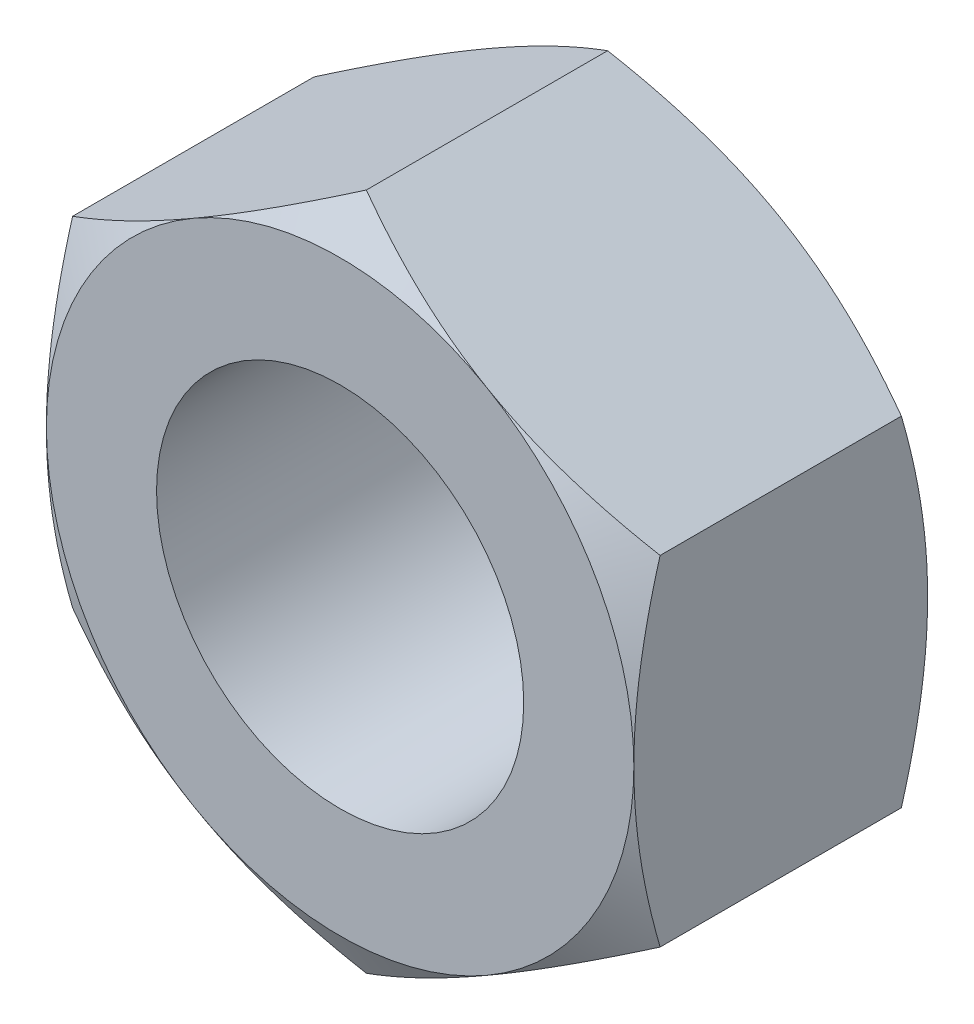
ISO-10303-21;
HEADER;
FILE_DESCRIPTION(('STEP AP214'),'2;1');
FILE_NAME('part.step','',(''),(''),'','','');
FILE_SCHEMA(('AUTOMOTIVE_DESIGN { 1 0 10303 214 1 1 1 1 }'));
ENDSEC;
DATA;
#1=APPLICATION_CONTEXT('core data for automotive mechanical design processes');
#2=APPLICATION_PROTOCOL_DEFINITION('international standard','automotive_design',2000,#1);
#3=PRODUCT_CONTEXT('',#1,'mechanical');
#4=PRODUCT('Part','Part','',(#3));
#5=PRODUCT_RELATED_PRODUCT_CATEGORY('part','',(#4));
#6=PRODUCT_DEFINITION_FORMATION('','',#4);
#7=PRODUCT_DEFINITION_CONTEXT('part definition',#1,'design');
#8=PRODUCT_DEFINITION('design','',#6,#7);
#9=PRODUCT_DEFINITION_SHAPE('','',#8);
#10=(LENGTH_UNIT() NAMED_UNIT(*) SI_UNIT(.MILLI.,.METRE.));
#11=(NAMED_UNIT(*) PLANE_ANGLE_UNIT() SI_UNIT($,.RADIAN.));
#12=(NAMED_UNIT(*) SI_UNIT($,.STERADIAN.) SOLID_ANGLE_UNIT());
#13=UNCERTAINTY_MEASURE_WITH_UNIT(LENGTH_MEASURE(1.E-05),#10,'distance_accuracy_value','');
#14=(GEOMETRIC_REPRESENTATION_CONTEXT(3) GLOBAL_UNCERTAINTY_ASSIGNED_CONTEXT((#13)) GLOBAL_UNIT_ASSIGNED_CONTEXT((#10,
#11,#12)) REPRESENTATION_CONTEXT('',''));
#15=CARTESIAN_POINT('',(0.,0.,0.));
#16=DIRECTION('',(0.,0.,1.));
#17=DIRECTION('',(1.,0.,0.));
#18=AXIS2_PLACEMENT_3D('',#15,#16,#17);
#19=CARTESIAN_POINT('',(-8.,13.856406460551,0.));
#20=DIRECTION('',(0.,0.,-1.));
#21=DIRECTION('',(-1.,0.,0.));
#22=AXIS2_PLACEMENT_3D('',#19,#20,#21);
#23=PLANE('',#22);
#24=CARTESIAN_POINT('',(0.,0.,0.));
#25=DIRECTION('',(0.,0.,1.));
#26=DIRECTION('',(1.,0.,0.));
#27=AXIS2_PLACEMENT_3D('',#24,#25,#26);
#28=CIRCLE('',#27,5.);
#29=CARTESIAN_POINT('',(5.,0.,0.));
#30=VERTEX_POINT('',#29);
#31=EDGE_CURVE('E316',#30,#30,#28,.T.);
#32=ORIENTED_EDGE('',*,*,#31,.F.);
#33=EDGE_LOOP('',(#32));
#34=FACE_BOUND('',#33,.T.);
#35=CARTESIAN_POINT('',(0.,0.,0.));
#36=DIRECTION('',(0.,0.,-1.));
#37=DIRECTION('',(-1.,0.,0.));
#38=AXIS2_PLACEMENT_3D('',#35,#36,#37);
#39=CIRCLE('',#38,8.);
#40=CARTESIAN_POINT('',(-8.,0.,0.));
#41=VERTEX_POINT('',#40);
#42=CARTESIAN_POINT('',(-4.,6.92820323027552,0.));
#43=VERTEX_POINT('',#42);
#44=EDGE_CURVE('E324',#41,#43,#39,.T.);
#45=ORIENTED_EDGE('',*,*,#44,.F.);
#46=CARTESIAN_POINT('',(0.,0.,0.));
#47=DIRECTION('',(0.,0.,-1.));
#48=DIRECTION('',(-1.,0.,0.));
#49=AXIS2_PLACEMENT_3D('',#46,#47,#48);
#50=CIRCLE('',#49,8.);
#51=CARTESIAN_POINT('',(-4.,-6.92820323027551,0.));
#52=VERTEX_POINT('',#51);
#53=EDGE_CURVE('E146',#41,#52,#50,.F.);
#54=ORIENTED_EDGE('',*,*,#53,.T.);
#55=CARTESIAN_POINT('',(4.,-6.92820323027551,0.));
#56=VERTEX_POINT('',#55);
#57=EDGE_CURVE('E248',#52,#56,#50,.F.);
#58=ORIENTED_EDGE('',*,*,#57,.T.);
#59=CARTESIAN_POINT('',(8.,0.,0.));
#60=VERTEX_POINT('',#59);
#61=EDGE_CURVE('E149',#56,#60,#50,.F.);
#62=ORIENTED_EDGE('',*,*,#61,.T.);
#63=CARTESIAN_POINT('',(4.,6.92820323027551,0.));
#64=VERTEX_POINT('',#63);
#65=EDGE_CURVE('E124',#60,#64,#50,.F.);
#66=ORIENTED_EDGE('',*,*,#65,.T.);
#67=EDGE_CURVE('E137',#64,#43,#50,.F.);
#68=ORIENTED_EDGE('',*,*,#67,.T.);
#69=EDGE_LOOP('',(#45,#54,#58,#62,#66,#68));
#70=FACE_BOUND('',#69,.T.);
#71=ADVANCED_FACE('F29',(#34,#70),#23,.F.);
#72=CARTESIAN_POINT('',(0.,0.,0.));
#73=DIRECTION('',(0.,0.,-1.));
#74=DIRECTION('',(-1.,0.,0.));
#75=AXIS2_PLACEMENT_3D('',#72,#73,#74);
#76=CONICAL_SURFACE('',#75,8.,1.0471975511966);
#77=CARTESIAN_POINT('',(-8.,-12.4289414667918,-3.9150243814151));
#78=CARTESIAN_POINT('',(-8.,-12.0792916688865,-3.74532345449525));
#79=CARTESIAN_POINT('',(-8.,-11.7288415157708,-3.57724345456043));
#80=CARTESIAN_POINT('',(-8.,-11.0259148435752,-3.24523667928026));
#81=CARTESIAN_POINT('',(-8.,-10.6734380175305,-3.08131055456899));
#82=CARTESIAN_POINT('',(-8.,-9.96422754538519,-2.75770323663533));
#83=CARTESIAN_POINT('',(-8.,-9.60748118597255,-2.598049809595));
#84=CARTESIAN_POINT('',(-8.,-8.89115828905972,-2.28524838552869));
#85=CARTESIAN_POINT('',(-8.,-8.53158188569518,-2.13210008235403));
#86=CARTESIAN_POINT('',(-8.,-7.79743820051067,-1.82924542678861));
#87=CARTESIAN_POINT('',(-8.,-7.42275986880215,-1.67980678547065));
#88=CARTESIAN_POINT('',(-8.,-6.66902920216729,-1.39218569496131));
#89=CARTESIAN_POINT('',(-8.,-6.28997638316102,-1.2540045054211));
#90=CARTESIAN_POINT('',(-8.,-5.52759087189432,-0.992509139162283));
#91=CARTESIAN_POINT('',(-8.,-5.14426853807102,-0.869165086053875));
#92=CARTESIAN_POINT('',(-8.,-4.37213964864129,-0.641285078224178));
#93=CARTESIAN_POINT('',(-8.,-3.98333485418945,-0.536743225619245));
#94=CARTESIAN_POINT('',(-8.,-3.2020639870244,-0.352019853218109));
#95=CARTESIAN_POINT('',(-8.,-2.80962942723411,-0.271708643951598));
#96=CARTESIAN_POINT('',(-8.,-2.21738673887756,-0.17289261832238));
#97=CARTESIAN_POINT('',(-8.,-2.01935997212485,-0.143561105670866));
#98=CARTESIAN_POINT('',(-8.,-1.62231457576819,-0.0926897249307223));
#99=CARTESIAN_POINT('',(-8.,-1.42329604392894,-0.0711491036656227));
#100=CARTESIAN_POINT('',(-8.,-1.02714522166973,-0.0365601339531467));
#101=CARTESIAN_POINT('',(-8.,-0.83002235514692,-0.0234042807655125));
#102=CARTESIAN_POINT('',(-8.,-0.435396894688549,-0.00544139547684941));
#103=CARTESIAN_POINT('',(-8.,-0.237894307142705,-0.000634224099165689));
#104=CARTESIAN_POINT('',(-8.,0.157138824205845,0.000516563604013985));
#105=CARTESIAN_POINT('',(-8.,0.354669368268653,-0.00313990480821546));
#106=CARTESIAN_POINT('',(-8.,0.749400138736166,-0.0188268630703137));
#107=CARTESIAN_POINT('',(-8.,0.946600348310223,-0.0308577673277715));
#108=CARTESIAN_POINT('',(-8.,1.4197678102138,-0.0695170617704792));
#109=CARTESIAN_POINT('',(-8.,1.69542073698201,-0.100076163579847));
#110=CARTESIAN_POINT('',(-8.,2.24468314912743,-0.175896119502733));
#111=CARTESIAN_POINT('',(-8.,2.51829235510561,-0.221158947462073));
#112=CARTESIAN_POINT('',(-8.,3.33573277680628,-0.376603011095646));
#113=CARTESIAN_POINT('',(-8.,3.87588099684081,-0.506412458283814));
#114=CARTESIAN_POINT('',(-8.,4.68375598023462,-0.731593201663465));
#115=CARTESIAN_POINT('',(-8.,4.95566805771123,-0.812812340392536));
#116=CARTESIAN_POINT('',(-8.,5.49685040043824,-0.983699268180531));
#117=CARTESIAN_POINT('',(-8.,5.76612064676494,-1.07336711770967));
#118=CARTESIAN_POINT('',(-8.,6.30210618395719,-1.25971133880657));
#119=CARTESIAN_POINT('',(-8.,6.56882226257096,-1.35638546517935));
#120=CARTESIAN_POINT('',(-8.,7.10004114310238,-1.55560318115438));
#121=CARTESIAN_POINT('',(-8.,7.36454398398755,-1.65814666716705));
#122=CARTESIAN_POINT('',(-8.,8.03954864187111,-1.92707319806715));
#123=CARTESIAN_POINT('',(-8.,8.44864651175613,-2.09697564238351));
#124=CARTESIAN_POINT('',(-8.,9.26296702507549,-2.44585611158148));
#125=CARTESIAN_POINT('',(-8.,9.66818933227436,-2.62483491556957));
#126=CARTESIAN_POINT('',(-8.,10.4755817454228,-2.98985031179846));
#127=CARTESIAN_POINT('',(-8.,10.87775088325,-3.1758890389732));
#128=CARTESIAN_POINT('',(-8.,11.6794880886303,-3.55344155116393));
#129=CARTESIAN_POINT('',(-8.,12.0790562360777,-3.74495516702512));
#130=CARTESIAN_POINT('',(-8.,12.8766152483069,-4.13259501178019));
#131=CARTESIAN_POINT('',(-8.,13.274603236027,-4.32872714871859));
#132=CARTESIAN_POINT('',(-8.,14.068831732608,-4.72449899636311));
#133=CARTESIAN_POINT('',(-8.,14.465072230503,-4.92413872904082));
#134=CARTESIAN_POINT('',(-8.,15.2560315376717,-5.32623624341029));
#135=CARTESIAN_POINT('',(-8.,15.650750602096,-5.52869352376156));
#136=CARTESIAN_POINT('',(-8.,16.4389741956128,-5.93595999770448));
#137=CARTESIAN_POINT('',(-8.,16.8324787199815,-6.14076920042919));
#138=CARTESIAN_POINT('',(-8.,17.9357396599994,-6.71846514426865));
#139=CARTESIAN_POINT('',(-8.,18.6443410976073,-7.09355729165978));
#140=CARTESIAN_POINT('',(-8.,20.0590897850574,-7.84841354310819));
#141=CARTESIAN_POINT('',(-8.,20.7652369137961,-8.22817787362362));
#142=CARTESIAN_POINT('',(-8.,22.1735698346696,-8.99010012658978));
#143=CARTESIAN_POINT('',(-8.,22.875761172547,-9.37224780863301));
#144=CARTESIAN_POINT('',(-8.,24.2786001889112,-10.1392568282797));
#145=CARTESIAN_POINT('',(-8.,24.9792479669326,-10.5241179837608));
#146=CARTESIAN_POINT('',(-8.,25.6793433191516,-10.9099740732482));
#147=B_SPLINE_CURVE_WITH_KNOTS('',3,(#77,#78,#79,#80,#81,#82,#83,#84,#85,#86,#87,#88,#89,#90,
#91,#92,#93,#94,#95,#96,#97,#98,#99,#100,#101,#102,#103,#104,#105,#106,#107,#108,#109,#110,#111,
#112,#113,#114,#115,#116,#117,#118,#119,#120,#121,#122,#123,#124,#125,#126,#127,#128,#129,#130,
#131,#132,#133,#134,#135,#136,#137,#138,#139,#140,#141,#142,#143,#144,#145,#146),.UNSPECIFIED.,
.F.,.F.,(4,2,2,2,2,2,2,2,2,2,2,2,2,2,2,2,2,2,2,2,2,2,2,2,2,2,2,2,2,2,2,2,2,2,4),(0.,
1.16598174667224,2.33214500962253,3.50461785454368,4.67703545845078,5.88703631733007,
7.09717238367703,8.30482938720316,9.51210690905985,10.7128031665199,11.3132358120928,
11.9136103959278,12.5061236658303,13.0986270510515,13.6911363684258,14.2836750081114,
15.1152308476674,15.9468983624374,17.6111205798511,18.4623977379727,19.3136809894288,
20.1646926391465,21.0156892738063,22.3444603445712,23.6733456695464,25.0026361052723,
26.3318855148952,27.6629391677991,28.9940011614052,30.3248292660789,31.6556625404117,
34.0608989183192,36.4662523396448,38.8645752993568,41.2627387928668),.UNSPECIFIED.);
#148=CARTESIAN_POINT('',(-8.,4.61880215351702,-0.714531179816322));
#149=VERTEX_POINT('',#148);
#150=EDGE_CURVE('E154',#149,#41,#147,.F.);
#151=ORIENTED_EDGE('',*,*,#150,.T.);
#152=ORIENTED_EDGE('',*,*,#44,.T.);
#153=CARTESIAN_POINT('',(0.000200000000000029,9.23771977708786,-0.714597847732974));
#154=CARTESIAN_POINT('',(-0.175648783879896,9.13619343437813,-0.655990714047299));
#155=CARTESIAN_POINT('',(-0.352153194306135,9.03428856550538,-0.600043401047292));
#156=CARTESIAN_POINT('',(-0.706595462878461,8.82965122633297,-0.494201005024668));
#157=CARTESIAN_POINT('',(-0.884533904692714,8.72691841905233,-0.444308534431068));
#158=CARTESIAN_POINT('',(-1.42119823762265,8.41707512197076,-0.304692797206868));
#159=CARTESIAN_POINT('',(-1.78204258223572,8.20874154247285,-0.225281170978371));
#160=CARTESIAN_POINT('',(-2.32203917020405,7.89697436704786,-0.132161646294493));
#161=CARTESIAN_POINT('',(-2.49957818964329,7.79447216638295,-0.105634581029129));
#162=CARTESIAN_POINT('',(-2.8554591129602,7.58900421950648,-0.0611531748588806));
#163=CARTESIAN_POINT('',(-3.03380094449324,7.48603851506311,-0.0431980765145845));
#164=CARTESIAN_POINT('',(-3.3907916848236,7.27992981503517,-0.0163156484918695));
#165=CARTESIAN_POINT('',(-3.5694400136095,7.17678715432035,-0.00737807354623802));
#166=CARTESIAN_POINT('',(-3.92690170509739,6.97040655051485,0.0012776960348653));
#167=CARTESIAN_POINT('',(-4.10571506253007,6.86716861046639,0.000996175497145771));
#168=CARTESIAN_POINT('',(-4.44001336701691,6.67416139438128,-0.00814502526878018));
#169=CARTESIAN_POINT('',(-4.59552190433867,6.58437849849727,-0.0158896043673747));
#170=CARTESIAN_POINT('',(-4.90617476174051,6.40502298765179,-0.038201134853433));
#171=CARTESIAN_POINT('',(-5.06131905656,6.31545038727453,-0.0527685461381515));
#172=CARTESIAN_POINT('',(-5.52615131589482,6.04707935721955,-0.106360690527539));
#173=CARTESIAN_POINT('',(-5.83501648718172,5.86875596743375,-0.155268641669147));
#174=CARTESIAN_POINT('',(-6.4560232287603,5.51021755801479,-0.277539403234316));
#175=CARTESIAN_POINT('',(-6.76808554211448,5.33004829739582,-0.351420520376));
#176=CARTESIAN_POINT('',(-7.38755648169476,4.97239658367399,-0.51910014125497));
#177=CARTESIAN_POINT('',(-7.69497304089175,4.79490955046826,-0.612859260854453));
#178=CARTESIAN_POINT('',(-8.0002,4.61868668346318,-0.714597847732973));
#179=B_SPLINE_CURVE_WITH_KNOTS('',3,(#153,#154,#155,#156,#157,#158,#159,#160,#161,#162,#163,
#164,#165,#166,#167,#168,#169,#170,#171,#172,#173,#174,#175,#176,#177,#178),.UNSPECIFIED.,.F.,
.F.,(4,2,2,2,2,2,2,2,2,2,2,2,4),(0.,0.633973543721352,1.26821965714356,2.53934712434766,
3.15934343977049,3.77928496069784,4.39852133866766,5.01773858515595,5.55680239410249,
6.09590254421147,7.17487077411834,8.27776850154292,9.37850115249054),.UNSPECIFIED.);
#180=EDGE_CURVE('E186',#43,#149,#179,.T.);
#181=ORIENTED_EDGE('',*,*,#180,.T.);
#182=EDGE_LOOP('',(#151,#152,#181));
#183=FACE_BOUND('',#182,.T.);
#184=ADVANCED_FACE('F173',(#183),#76,.T.);
#185=CARTESIAN_POINT('',(8.0002,4.61868668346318,-0.714597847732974));
#186=CARTESIAN_POINT('',(7.8243512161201,4.72021302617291,-0.655990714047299));
#187=CARTESIAN_POINT('',(7.64784680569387,4.82211789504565,-0.600043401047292));
#188=CARTESIAN_POINT('',(7.29340453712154,5.02675523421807,-0.494201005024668));
#189=CARTESIAN_POINT('',(7.11546609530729,5.12948804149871,-0.444308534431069));
#190=CARTESIAN_POINT('',(6.57880176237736,5.43933133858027,-0.304692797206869));
#191=CARTESIAN_POINT('',(6.21795741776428,5.64766491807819,-0.225281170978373));
#192=CARTESIAN_POINT('',(5.67796082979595,5.95943209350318,-0.132161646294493));
#193=CARTESIAN_POINT('',(5.50042181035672,6.06193429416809,-0.105634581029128));
#194=CARTESIAN_POINT('',(5.1445408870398,6.26740224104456,-0.0611531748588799));
#195=CARTESIAN_POINT('',(4.96619905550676,6.37036794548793,-0.0431980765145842));
#196=CARTESIAN_POINT('',(4.6092083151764,6.57647664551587,-0.0163156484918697));
#197=CARTESIAN_POINT('',(4.4305599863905,6.67961930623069,-0.00737807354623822));
#198=CARTESIAN_POINT('',(4.07309829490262,6.88599991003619,0.00127769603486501));
#199=CARTESIAN_POINT('',(3.89428493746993,6.98923785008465,0.000996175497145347));
#200=CARTESIAN_POINT('',(3.55998663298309,7.18224506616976,-0.00814502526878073));
#201=CARTESIAN_POINT('',(3.40447809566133,7.27202796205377,-0.0158896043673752));
#202=CARTESIAN_POINT('',(3.09382523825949,7.45138347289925,-0.0382011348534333));
#203=CARTESIAN_POINT('',(2.93868094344,7.54095607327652,-0.0527685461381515));
#204=CARTESIAN_POINT('',(2.47384868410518,7.80932710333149,-0.106360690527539));
#205=CARTESIAN_POINT('',(2.16498351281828,7.98765049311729,-0.155268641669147));
#206=CARTESIAN_POINT('',(1.5439767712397,8.34618890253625,-0.277539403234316));
#207=CARTESIAN_POINT('',(1.23191445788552,8.52635816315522,-0.351420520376));
#208=CARTESIAN_POINT('',(0.612443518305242,8.88400987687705,-0.519100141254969));
#209=CARTESIAN_POINT('',(0.30502695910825,9.06149691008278,-0.612859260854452));
#210=CARTESIAN_POINT('',(-0.000199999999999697,9.23771977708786,-0.714597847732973));
#211=B_SPLINE_CURVE_WITH_KNOTS('',3,(#185,#186,#187,#188,#189,#190,#191,#192,#193,#194,#195,
#196,#197,#198,#199,#200,#201,#202,#203,#204,#205,#206,#207,#208,#209,#210),.UNSPECIFIED.,.F.,
.F.,(4,2,2,2,2,2,2,2,2,2,2,2,4),(0.,0.633973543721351,1.26821965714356,2.53934712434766,
3.15934343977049,3.77928496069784,4.39852133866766,5.01773858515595,5.55680239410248,
6.09590254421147,7.17487077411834,8.27776850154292,9.37850115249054),.UNSPECIFIED.);
#212=CARTESIAN_POINT('',(0.,9.23760430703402,-0.714531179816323));
#213=VERTEX_POINT('',#212);
#214=EDGE_CURVE('E133',#64,#213,#211,.T.);
#215=ORIENTED_EDGE('',*,*,#214,.T.);
#216=EDGE_CURVE('E140',#213,#43,#179,.T.);
#217=ORIENTED_EDGE('',*,*,#216,.T.);
#218=ORIENTED_EDGE('',*,*,#67,.F.);
#219=EDGE_LOOP('',(#215,#217,#218));
#220=FACE_BOUND('',#219,.T.);
#221=ADVANCED_FACE('F138',(#220),#76,.T.);
#222=CARTESIAN_POINT('',(8.,-12.4289414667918,-3.9150243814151));
#223=CARTESIAN_POINT('',(8.,-12.0792916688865,-3.74532345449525));
#224=CARTESIAN_POINT('',(8.,-11.7288415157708,-3.57724345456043));
#225=CARTESIAN_POINT('',(8.,-11.0259148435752,-3.24523667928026));
#226=CARTESIAN_POINT('',(8.,-10.6734380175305,-3.08131055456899));
#227=CARTESIAN_POINT('',(8.,-9.96422754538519,-2.75770323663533));
#228=CARTESIAN_POINT('',(8.,-9.60748118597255,-2.598049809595));
#229=CARTESIAN_POINT('',(8.,-8.89115828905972,-2.28524838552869));
#230=CARTESIAN_POINT('',(8.,-8.53158188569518,-2.13210008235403));
#231=CARTESIAN_POINT('',(8.,-7.79743820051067,-1.82924542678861));
#232=CARTESIAN_POINT('',(8.,-7.42275986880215,-1.67980678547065));
#233=CARTESIAN_POINT('',(8.,-6.66902920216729,-1.39218569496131));
#234=CARTESIAN_POINT('',(8.,-6.28997638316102,-1.2540045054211));
#235=CARTESIAN_POINT('',(8.,-5.52759087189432,-0.992509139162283));
#236=CARTESIAN_POINT('',(8.,-5.14426853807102,-0.869165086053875));
#237=CARTESIAN_POINT('',(8.,-4.37213964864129,-0.641285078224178));
#238=CARTESIAN_POINT('',(8.,-3.98333485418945,-0.536743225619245));
#239=CARTESIAN_POINT('',(8.,-3.2020639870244,-0.352019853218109));
#240=CARTESIAN_POINT('',(8.,-2.80962942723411,-0.271708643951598));
#241=CARTESIAN_POINT('',(8.,-2.21738673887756,-0.17289261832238));
#242=CARTESIAN_POINT('',(8.,-2.01935997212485,-0.143561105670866));
#243=CARTESIAN_POINT('',(8.,-1.62231457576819,-0.0926897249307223));
#244=CARTESIAN_POINT('',(8.,-1.42329604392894,-0.0711491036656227));
#245=CARTESIAN_POINT('',(8.,-1.02714522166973,-0.0365601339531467));
#246=CARTESIAN_POINT('',(8.,-0.83002235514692,-0.0234042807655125));
#247=CARTESIAN_POINT('',(8.,-0.435396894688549,-0.00544139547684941));
#248=CARTESIAN_POINT('',(8.,-0.237894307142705,-0.000634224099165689));
#249=CARTESIAN_POINT('',(8.,0.157138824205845,0.000516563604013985));
#250=CARTESIAN_POINT('',(8.,0.354669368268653,-0.00313990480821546));
#251=CARTESIAN_POINT('',(8.,0.749400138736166,-0.0188268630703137));
#252=CARTESIAN_POINT('',(8.,0.946600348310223,-0.0308577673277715));
#253=CARTESIAN_POINT('',(8.,1.4197678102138,-0.0695170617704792));
#254=CARTESIAN_POINT('',(8.,1.69542073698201,-0.100076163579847));
#255=CARTESIAN_POINT('',(8.,2.24468314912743,-0.175896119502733));
#256=CARTESIAN_POINT('',(8.,2.51829235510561,-0.221158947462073));
#257=CARTESIAN_POINT('',(8.,3.33573277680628,-0.376603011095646));
#258=CARTESIAN_POINT('',(8.,3.87588099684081,-0.506412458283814));
#259=CARTESIAN_POINT('',(8.,4.68375598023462,-0.731593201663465));
#260=CARTESIAN_POINT('',(8.,4.95566805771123,-0.812812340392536));
#261=CARTESIAN_POINT('',(8.,5.49685040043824,-0.983699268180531));
#262=CARTESIAN_POINT('',(8.,5.76612064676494,-1.07336711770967));
#263=CARTESIAN_POINT('',(8.,6.30210618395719,-1.25971133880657));
#264=CARTESIAN_POINT('',(8.,6.56882226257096,-1.35638546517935));
#265=CARTESIAN_POINT('',(8.,7.10004114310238,-1.55560318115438));
#266=CARTESIAN_POINT('',(8.,7.36454398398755,-1.65814666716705));
#267=CARTESIAN_POINT('',(8.,8.03954864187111,-1.92707319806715));
#268=CARTESIAN_POINT('',(8.,8.44864651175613,-2.09697564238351));
#269=CARTESIAN_POINT('',(8.,9.26296702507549,-2.44585611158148));
#270=CARTESIAN_POINT('',(8.,9.66818933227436,-2.62483491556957));
#271=CARTESIAN_POINT('',(8.,10.4755817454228,-2.98985031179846));
#272=CARTESIAN_POINT('',(8.,10.87775088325,-3.1758890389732));
#273=CARTESIAN_POINT('',(8.,11.6794880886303,-3.55344155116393));
#274=CARTESIAN_POINT('',(8.,12.0790562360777,-3.74495516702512));
#275=CARTESIAN_POINT('',(8.,12.8766152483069,-4.13259501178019));
#276=CARTESIAN_POINT('',(8.,13.274603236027,-4.32872714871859));
#277=CARTESIAN_POINT('',(8.,14.068831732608,-4.72449899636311));
#278=CARTESIAN_POINT('',(8.,14.465072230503,-4.92413872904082));
#279=CARTESIAN_POINT('',(8.,15.2560315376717,-5.32623624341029));
#280=CARTESIAN_POINT('',(8.,15.650750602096,-5.52869352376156));
#281=CARTESIAN_POINT('',(8.,16.4389741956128,-5.93595999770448));
#282=CARTESIAN_POINT('',(8.,16.8324787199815,-6.14076920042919));
#283=CARTESIAN_POINT('',(8.,17.9357396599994,-6.71846514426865));
#284=CARTESIAN_POINT('',(8.,18.6443410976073,-7.09355729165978));
#285=CARTESIAN_POINT('',(8.,20.0590897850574,-7.84841354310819));
#286=CARTESIAN_POINT('',(8.,20.7652369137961,-8.22817787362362));
#287=CARTESIAN_POINT('',(8.,22.1735698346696,-8.99010012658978));
#288=CARTESIAN_POINT('',(8.,22.875761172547,-9.37224780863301));
#289=CARTESIAN_POINT('',(8.,24.2786001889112,-10.1392568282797));
#290=CARTESIAN_POINT('',(8.,24.9792479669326,-10.5241179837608));
#291=CARTESIAN_POINT('',(8.,25.6793433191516,-10.9099740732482));
#292=B_SPLINE_CURVE_WITH_KNOTS('',3,(#222,#223,#224,#225,#226,#227,#228,#229,#230,#231,#232,
#233,#234,#235,#236,#237,#238,#239,#240,#241,#242,#243,#244,#245,#246,#247,#248,#249,#250,#251,
#252,#253,#254,#255,#256,#257,#258,#259,#260,#261,#262,#263,#264,#265,#266,#267,#268,#269,#270,
#271,#272,#273,#274,#275,#276,#277,#278,#279,#280,#281,#282,#283,#284,#285,#286,#287,#288,#289,
#290,#291),.UNSPECIFIED.,.F.,.F.,(4,2,2,2,2,2,2,2,2,2,2,2,2,2,2,2,2,2,2,2,2,2,2,2,2,2,2,2,2,2,2,
2,2,2,4),(0.,1.16598174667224,2.33214500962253,3.50461785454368,4.67703545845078,
5.88703631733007,7.09717238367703,8.30482938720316,9.51210690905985,10.7128031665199,
11.3132358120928,11.9136103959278,12.5061236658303,13.0986270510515,13.6911363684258,
14.2836750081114,15.1152308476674,15.9468983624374,17.6111205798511,18.4623977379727,
19.3136809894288,20.1646926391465,21.0156892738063,22.3444603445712,23.6733456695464,
25.0026361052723,26.3318855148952,27.6629391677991,28.9940011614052,30.3248292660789,
31.6556625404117,34.0608989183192,36.4662523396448,38.8645752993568,41.2627387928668),.UNSPECIFIED.);
#293=CARTESIAN_POINT('',(8.,4.61880215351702,-0.714531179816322));
#294=VERTEX_POINT('',#293);
#295=EDGE_CURVE('E127',#60,#294,#292,.T.);
#296=ORIENTED_EDGE('',*,*,#295,.T.);
#297=EDGE_CURVE('E120',#294,#64,#211,.T.);
#298=ORIENTED_EDGE('',*,*,#297,.T.);
#299=ORIENTED_EDGE('',*,*,#65,.F.);
#300=EDGE_LOOP('',(#296,#298,#299));
#301=FACE_BOUND('',#300,.T.);
#302=ADVANCED_FACE('F122',(#301),#76,.T.);
#303=CARTESIAN_POINT('',(-0.000200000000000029,-9.23771977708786,-0.714597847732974));
#304=CARTESIAN_POINT('',(0.175648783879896,-9.13619343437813,-0.655990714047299));
#305=CARTESIAN_POINT('',(0.352153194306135,-9.03428856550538,-0.600043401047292));
#306=CARTESIAN_POINT('',(0.706595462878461,-8.82965122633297,-0.494201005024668));
#307=CARTESIAN_POINT('',(0.884533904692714,-8.72691841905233,-0.444308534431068));
#308=CARTESIAN_POINT('',(1.42119823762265,-8.41707512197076,-0.304692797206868));
#309=CARTESIAN_POINT('',(1.78204258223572,-8.20874154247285,-0.225281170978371));
#310=CARTESIAN_POINT('',(2.32203917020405,-7.89697436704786,-0.132161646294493));
#311=CARTESIAN_POINT('',(2.49957818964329,-7.79447216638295,-0.105634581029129));
#312=CARTESIAN_POINT('',(2.8554591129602,-7.58900421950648,-0.0611531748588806));
#313=CARTESIAN_POINT('',(3.03380094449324,-7.48603851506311,-0.0431980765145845));
#314=CARTESIAN_POINT('',(3.3907916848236,-7.27992981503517,-0.0163156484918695));
#315=CARTESIAN_POINT('',(3.5694400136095,-7.17678715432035,-0.00737807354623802));
#316=CARTESIAN_POINT('',(3.92690170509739,-6.97040655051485,0.0012776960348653));
#317=CARTESIAN_POINT('',(4.10571506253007,-6.86716861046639,0.000996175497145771));
#318=CARTESIAN_POINT('',(4.44001336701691,-6.67416139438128,-0.00814502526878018));
#319=CARTESIAN_POINT('',(4.59552190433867,-6.58437849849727,-0.0158896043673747));
#320=CARTESIAN_POINT('',(4.90617476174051,-6.40502298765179,-0.038201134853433));
#321=CARTESIAN_POINT('',(5.06131905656,-6.31545038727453,-0.0527685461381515));
#322=CARTESIAN_POINT('',(5.52615131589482,-6.04707935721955,-0.106360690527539));
#323=CARTESIAN_POINT('',(5.83501648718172,-5.86875596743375,-0.155268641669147));
#324=CARTESIAN_POINT('',(6.4560232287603,-5.51021755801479,-0.277539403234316));
#325=CARTESIAN_POINT('',(6.76808554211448,-5.33004829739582,-0.351420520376));
#326=CARTESIAN_POINT('',(7.38755648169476,-4.97239658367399,-0.51910014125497));
#327=CARTESIAN_POINT('',(7.69497304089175,-4.79490955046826,-0.612859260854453));
#328=CARTESIAN_POINT('',(8.0002,-4.61868668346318,-0.714597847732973));
#329=B_SPLINE_CURVE_WITH_KNOTS('',3,(#303,#304,#305,#306,#307,#308,#309,#310,#311,#312,#313,
#314,#315,#316,#317,#318,#319,#320,#321,#322,#323,#324,#325,#326,#327,#328),.UNSPECIFIED.,.F.,
.F.,(4,2,2,2,2,2,2,2,2,2,2,2,4),(0.,0.633973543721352,1.26821965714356,2.53934712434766,
3.15934343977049,3.77928496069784,4.39852133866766,5.01773858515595,5.55680239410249,
6.09590254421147,7.17487077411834,8.27776850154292,9.37850115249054),.UNSPECIFIED.);
#330=CARTESIAN_POINT('',(8.,-4.61880215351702,-0.714531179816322));
#331=VERTEX_POINT('',#330);
#332=EDGE_CURVE('E200',#56,#331,#329,.T.);
#333=ORIENTED_EDGE('',*,*,#332,.T.);
#334=EDGE_CURVE('E199',#331,#60,#292,.T.);
#335=ORIENTED_EDGE('',*,*,#334,.T.);
#336=ORIENTED_EDGE('',*,*,#61,.F.);
#337=EDGE_LOOP('',(#333,#335,#336));
#338=FACE_BOUND('',#337,.T.);
#339=ADVANCED_FACE('F424',(#338),#76,.T.);
#340=CARTESIAN_POINT('',(0.,-9.23760430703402,-0.714531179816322));
#341=VERTEX_POINT('',#340);
#342=EDGE_CURVE('E258',#341,#56,#329,.T.);
#343=ORIENTED_EDGE('',*,*,#342,.T.);
#344=ORIENTED_EDGE('',*,*,#57,.F.);
#345=CARTESIAN_POINT('',(-8.0002,-4.61868668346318,-0.714597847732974));
#346=CARTESIAN_POINT('',(-7.8243512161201,-4.72021302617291,-0.655990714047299));
#347=CARTESIAN_POINT('',(-7.64784680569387,-4.82211789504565,-0.600043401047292));
#348=CARTESIAN_POINT('',(-7.29340453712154,-5.02675523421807,-0.494201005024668));
#349=CARTESIAN_POINT('',(-7.11546609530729,-5.12948804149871,-0.444308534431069));
#350=CARTESIAN_POINT('',(-6.57880176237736,-5.43933133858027,-0.304692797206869));
#351=CARTESIAN_POINT('',(-6.21795741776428,-5.64766491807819,-0.225281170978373));
#352=CARTESIAN_POINT('',(-5.67796082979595,-5.95943209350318,-0.132161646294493));
#353=CARTESIAN_POINT('',(-5.50042181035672,-6.06193429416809,-0.105634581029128));
#354=CARTESIAN_POINT('',(-5.1445408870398,-6.26740224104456,-0.0611531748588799));
#355=CARTESIAN_POINT('',(-4.96619905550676,-6.37036794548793,-0.0431980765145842));
#356=CARTESIAN_POINT('',(-4.6092083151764,-6.57647664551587,-0.0163156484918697));
#357=CARTESIAN_POINT('',(-4.4305599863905,-6.67961930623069,-0.00737807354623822));
#358=CARTESIAN_POINT('',(-4.07309829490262,-6.88599991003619,0.00127769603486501));
#359=CARTESIAN_POINT('',(-3.89428493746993,-6.98923785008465,0.000996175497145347));
#360=CARTESIAN_POINT('',(-3.55998663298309,-7.18224506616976,-0.00814502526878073));
#361=CARTESIAN_POINT('',(-3.40447809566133,-7.27202796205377,-0.0158896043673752));
#362=CARTESIAN_POINT('',(-3.09382523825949,-7.45138347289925,-0.0382011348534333));
#363=CARTESIAN_POINT('',(-2.93868094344,-7.54095607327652,-0.0527685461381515));
#364=CARTESIAN_POINT('',(-2.47384868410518,-7.80932710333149,-0.106360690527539));
#365=CARTESIAN_POINT('',(-2.16498351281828,-7.98765049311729,-0.155268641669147));
#366=CARTESIAN_POINT('',(-1.5439767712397,-8.34618890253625,-0.277539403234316));
#367=CARTESIAN_POINT('',(-1.23191445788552,-8.52635816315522,-0.351420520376));
#368=CARTESIAN_POINT('',(-0.612443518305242,-8.88400987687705,-0.519100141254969));
#369=CARTESIAN_POINT('',(-0.30502695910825,-9.06149691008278,-0.612859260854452));
#370=CARTESIAN_POINT('',(0.000199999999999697,-9.23771977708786,-0.714597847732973));
#371=B_SPLINE_CURVE_WITH_KNOTS('',3,(#345,#346,#347,#348,#349,#350,#351,#352,#353,#354,#355,
#356,#357,#358,#359,#360,#361,#362,#363,#364,#365,#366,#367,#368,#369,#370),.UNSPECIFIED.,.F.,
.F.,(4,2,2,2,2,2,2,2,2,2,2,2,4),(0.,0.633973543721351,1.26821965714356,2.53934712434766,
3.15934343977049,3.77928496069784,4.39852133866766,5.01773858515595,5.55680239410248,
6.09590254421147,7.17487077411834,8.27776850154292,9.37850115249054),.UNSPECIFIED.);
#372=EDGE_CURVE('E262',#52,#341,#371,.T.);
#373=ORIENTED_EDGE('',*,*,#372,.T.);
#374=EDGE_LOOP('',(#343,#344,#373));
#375=FACE_BOUND('',#374,.T.);
#376=ADVANCED_FACE('F179',(#375),#76,.T.);
#377=CARTESIAN_POINT('',(-8.,-4.61880215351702,-0.714531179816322));
#378=VERTEX_POINT('',#377);
#379=EDGE_CURVE('E167',#378,#52,#371,.T.);
#380=ORIENTED_EDGE('',*,*,#379,.T.);
#381=ORIENTED_EDGE('',*,*,#53,.F.);
#382=EDGE_CURVE('E132',#41,#378,#147,.F.);
#383=ORIENTED_EDGE('',*,*,#382,.T.);
#384=EDGE_LOOP('',(#380,#381,#383));
#385=FACE_BOUND('',#384,.T.);
#386=ADVANCED_FACE('F267',(#385),#76,.T.);
#387=CARTESIAN_POINT('',(8.,4.61880215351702,-8.));
#388=DIRECTION('',(0.499999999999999,0.866025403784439,0.));
#389=DIRECTION('',(-0.866025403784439,0.5,0.));
#390=AXIS2_PLACEMENT_3D('',#387,#388,#389);
#391=PLANE('',#390);
#392=CARTESIAN_POINT('',(-0.0002,9.23771977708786,-7.28540215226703));
#393=CARTESIAN_POINT('',(0.175648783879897,9.13619343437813,-7.3440092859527));
#394=CARTESIAN_POINT('',(0.352153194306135,9.03428856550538,-7.39995659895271));
#395=CARTESIAN_POINT('',(0.706595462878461,8.82965122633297,-7.50579899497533));
#396=CARTESIAN_POINT('',(0.884533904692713,8.72691841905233,-7.55569146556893));
#397=CARTESIAN_POINT('',(1.42119823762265,8.41707512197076,-7.69530720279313));
#398=CARTESIAN_POINT('',(1.78204258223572,8.20874154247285,-7.77471882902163));
#399=CARTESIAN_POINT('',(2.32203917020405,7.89697436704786,-7.86783835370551));
#400=CARTESIAN_POINT('',(2.49957818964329,7.79447216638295,-7.89436541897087));
#401=CARTESIAN_POINT('',(2.8554591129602,7.58900421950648,-7.93884682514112));
#402=CARTESIAN_POINT('',(3.03380094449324,7.48603851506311,-7.95680192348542));
#403=CARTESIAN_POINT('',(3.3907916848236,7.27992981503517,-7.98368435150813));
#404=CARTESIAN_POINT('',(3.5694400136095,7.17678715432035,-7.99262192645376));
#405=CARTESIAN_POINT('',(3.92690170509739,6.97040655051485,-8.00127769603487));
#406=CARTESIAN_POINT('',(4.10571506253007,6.86716861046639,-8.00099617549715));
#407=CARTESIAN_POINT('',(4.44001336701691,6.67416139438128,-7.99185497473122));
#408=CARTESIAN_POINT('',(4.59552190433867,6.58437849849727,-7.98411039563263));
#409=CARTESIAN_POINT('',(4.90617476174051,6.40502298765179,-7.96179886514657));
#410=CARTESIAN_POINT('',(5.06131905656,6.31545038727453,-7.94723145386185));
#411=CARTESIAN_POINT('',(5.52615131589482,6.04707935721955,-7.89363930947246));
#412=CARTESIAN_POINT('',(5.83501648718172,5.86875596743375,-7.84473135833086));
#413=CARTESIAN_POINT('',(6.4560232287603,5.51021755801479,-7.72246059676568));
#414=CARTESIAN_POINT('',(6.76808554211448,5.33004829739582,-7.648579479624));
#415=CARTESIAN_POINT('',(7.38755648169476,4.97239658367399,-7.48089985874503));
#416=CARTESIAN_POINT('',(7.69497304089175,4.79490955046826,-7.38714073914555));
#417=CARTESIAN_POINT('',(8.0002,4.61868668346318,-7.28540215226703));
#418=B_SPLINE_CURVE_WITH_KNOTS('',3,(#392,#393,#394,#395,#396,#397,#398,#399,#400,#401,#402,
#403,#404,#405,#406,#407,#408,#409,#410,#411,#412,#413,#414,#415,#416,#417),.UNSPECIFIED.,.F.,
.F.,(4,2,2,2,2,2,2,2,2,2,2,2,4),(0.,0.633973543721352,1.26821965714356,2.53934712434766,
3.15934343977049,3.77928496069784,4.39852133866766,5.01773858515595,5.55680239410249,
6.09590254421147,7.17487077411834,8.27776850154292,9.37850115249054),.UNSPECIFIED.);
#419=CARTESIAN_POINT('',(0.,9.23760430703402,-7.28546882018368));
#420=VERTEX_POINT('',#419);
#421=CARTESIAN_POINT('',(4.,6.92820323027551,-8.));
#422=VERTEX_POINT('',#421);
#423=EDGE_CURVE('E233',#420,#422,#418,.T.);
#424=ORIENTED_EDGE('',*,*,#423,.F.);
#425=DIRECTION('',(0.,0.,1.));
#426=VECTOR('',#425,1.);
#427=CARTESIAN_POINT('',(0.,9.23760430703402,-8.));
#428=LINE('',#427,#426);
#429=EDGE_CURVE('E153',#420,#213,#428,.T.);
#430=ORIENTED_EDGE('',*,*,#429,.T.);
#431=ORIENTED_EDGE('',*,*,#214,.F.);
#432=ORIENTED_EDGE('',*,*,#297,.F.);
#433=DIRECTION('',(0.,0.,1.));
#434=VECTOR('',#433,1.);
#435=CARTESIAN_POINT('',(8.,4.61880215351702,-8.));
#436=LINE('',#435,#434);
#437=CARTESIAN_POINT('',(8.,4.61880215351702,-7.28546882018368));
#438=VERTEX_POINT('',#437);
#439=EDGE_CURVE('E145',#438,#294,#436,.T.);
#440=ORIENTED_EDGE('',*,*,#439,.F.);
#441=EDGE_CURVE('E228',#422,#438,#418,.T.);
#442=ORIENTED_EDGE('',*,*,#441,.F.);
#443=EDGE_LOOP('',(#424,#430,#431,#432,#440,#442));
#444=FACE_BOUND('',#443,.T.);
#445=ADVANCED_FACE('F31',(#444),#391,.T.);
#446=CARTESIAN_POINT('',(8.,-4.61880215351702,-8.));
#447=DIRECTION('',(1.,0.,0.));
#448=DIRECTION('',(0.,0.,-1.));
#449=AXIS2_PLACEMENT_3D('',#446,#447,#448);
#450=PLANE('',#449);
#451=CARTESIAN_POINT('',(8.,-12.4289414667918,-4.0849756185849));
#452=CARTESIAN_POINT('',(8.,-12.0792916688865,-4.25467654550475));
#453=CARTESIAN_POINT('',(8.,-11.7288415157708,-4.42275654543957));
#454=CARTESIAN_POINT('',(8.,-11.0259148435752,-4.75476332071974));
#455=CARTESIAN_POINT('',(8.,-10.6734380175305,-4.91868944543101));
#456=CARTESIAN_POINT('',(8.,-9.96422754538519,-5.24229676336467));
#457=CARTESIAN_POINT('',(8.,-9.60748118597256,-5.401950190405));
#458=CARTESIAN_POINT('',(8.,-8.89115828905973,-5.71475161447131));
#459=CARTESIAN_POINT('',(8.,-8.53158188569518,-5.86789991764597));
#460=CARTESIAN_POINT('',(8.,-7.79743820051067,-6.17075457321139));
#461=CARTESIAN_POINT('',(8.,-7.42275986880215,-6.32019321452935));
#462=CARTESIAN_POINT('',(8.,-6.66902920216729,-6.60781430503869));
#463=CARTESIAN_POINT('',(8.,-6.28997638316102,-6.74599549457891));
#464=CARTESIAN_POINT('',(8.,-5.52759087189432,-7.00749086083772));
#465=CARTESIAN_POINT('',(8.,-5.14426853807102,-7.13083491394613));
#466=CARTESIAN_POINT('',(8.,-4.37213964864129,-7.35871492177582));
#467=CARTESIAN_POINT('',(8.,-3.98333485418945,-7.46325677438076));
#468=CARTESIAN_POINT('',(8.,-3.2020639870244,-7.64798014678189));
#469=CARTESIAN_POINT('',(8.,-2.80962942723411,-7.7282913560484));
#470=CARTESIAN_POINT('',(8.,-2.21738673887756,-7.82710738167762));
#471=CARTESIAN_POINT('',(8.,-2.01935997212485,-7.85643889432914));
#472=CARTESIAN_POINT('',(8.,-1.62231457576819,-7.90731027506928));
#473=CARTESIAN_POINT('',(8.,-1.42329604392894,-7.92885089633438));
#474=CARTESIAN_POINT('',(8.,-1.02714522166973,-7.96343986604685));
#475=CARTESIAN_POINT('',(8.,-0.83002235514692,-7.97659571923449));
#476=CARTESIAN_POINT('',(8.,-0.435396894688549,-7.99455860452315));
#477=CARTESIAN_POINT('',(8.,-0.237894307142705,-7.99936577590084));
#478=CARTESIAN_POINT('',(8.,0.157138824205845,-8.00051656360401));
#479=CARTESIAN_POINT('',(8.,0.354669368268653,-7.99686009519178));
#480=CARTESIAN_POINT('',(8.,0.749400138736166,-7.98117313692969));
#481=CARTESIAN_POINT('',(8.,0.946600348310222,-7.96914223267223));
#482=CARTESIAN_POINT('',(8.,1.4197678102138,-7.93048293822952));
#483=CARTESIAN_POINT('',(8.,1.69542073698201,-7.89992383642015));
#484=CARTESIAN_POINT('',(8.,2.24468314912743,-7.82410388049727));
#485=CARTESIAN_POINT('',(8.,2.51829235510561,-7.77884105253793));
#486=CARTESIAN_POINT('',(8.,3.33573277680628,-7.62339698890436));
#487=CARTESIAN_POINT('',(8.,3.87588099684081,-7.49358754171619));
#488=CARTESIAN_POINT('',(8.,4.68375598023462,-7.26840679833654));
#489=CARTESIAN_POINT('',(8.,4.95566805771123,-7.18718765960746));
#490=CARTESIAN_POINT('',(8.,5.49685040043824,-7.01630073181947));
#491=CARTESIAN_POINT('',(8.,5.76612064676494,-6.92663288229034));
#492=CARTESIAN_POINT('',(8.,6.30210618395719,-6.74028866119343));
#493=CARTESIAN_POINT('',(8.,6.56882226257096,-6.64361453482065));
#494=CARTESIAN_POINT('',(8.,7.10004114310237,-6.44439681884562));
#495=CARTESIAN_POINT('',(8.,7.36454398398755,-6.34185333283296));
#496=CARTESIAN_POINT('',(8.,8.03954864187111,-6.07292680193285));
#497=CARTESIAN_POINT('',(8.,8.44864651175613,-5.90302435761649));
#498=CARTESIAN_POINT('',(8.,9.26296702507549,-5.55414388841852));
#499=CARTESIAN_POINT('',(8.,9.66818933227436,-5.37516508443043));
#500=CARTESIAN_POINT('',(8.,10.4755817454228,-5.01014968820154));
#501=CARTESIAN_POINT('',(8.,10.87775088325,-4.8241109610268));
#502=CARTESIAN_POINT('',(8.,11.6794880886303,-4.44655844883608));
#503=CARTESIAN_POINT('',(8.,12.0790562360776,-4.25504483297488));
#504=CARTESIAN_POINT('',(8.,12.8766152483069,-3.86740498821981));
#505=CARTESIAN_POINT('',(8.,13.274603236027,-3.67127285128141));
#506=CARTESIAN_POINT('',(8.,14.068831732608,-3.2755010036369));
#507=CARTESIAN_POINT('',(8.,14.465072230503,-3.07586127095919));
#508=CARTESIAN_POINT('',(8.,15.2560315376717,-2.67376375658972));
#509=CARTESIAN_POINT('',(8.,15.650750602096,-2.47130647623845));
#510=CARTESIAN_POINT('',(8.,16.4389741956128,-2.06404000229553));
#511=CARTESIAN_POINT('',(8.,16.8324787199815,-1.85923079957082));
#512=CARTESIAN_POINT('',(8.,17.9357396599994,-1.28153485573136));
#513=CARTESIAN_POINT('',(8.,18.6443410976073,-0.906442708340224));
#514=CARTESIAN_POINT('',(8.,20.0590897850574,-0.151586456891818));
#515=CARTESIAN_POINT('',(8.,20.7652369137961,0.228177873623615));
#516=CARTESIAN_POINT('',(8.,22.1735698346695,0.990100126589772));
#517=CARTESIAN_POINT('',(8.,22.875761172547,1.372247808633));
#518=CARTESIAN_POINT('',(8.,24.2786001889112,2.13925682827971));
#519=CARTESIAN_POINT('',(8.,24.9792479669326,2.52411798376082));
#520=CARTESIAN_POINT('',(8.,25.6793433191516,2.9099740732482));
#521=B_SPLINE_CURVE_WITH_KNOTS('',3,(#451,#452,#453,#454,#455,#456,#457,#458,#459,#460,#461,
#462,#463,#464,#465,#466,#467,#468,#469,#470,#471,#472,#473,#474,#475,#476,#477,#478,#479,#480,
#481,#482,#483,#484,#485,#486,#487,#488,#489,#490,#491,#492,#493,#494,#495,#496,#497,#498,#499,
#500,#501,#502,#503,#504,#505,#506,#507,#508,#509,#510,#511,#512,#513,#514,#515,#516,#517,#518,
#519,#520),.UNSPECIFIED.,.F.,.F.,(4,2,2,2,2,2,2,2,2,2,2,2,2,2,2,2,2,2,2,2,2,2,2,2,2,2,2,2,2,2,2,
2,2,2,4),(0.,1.16598174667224,2.33214500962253,3.50461785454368,4.67703545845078,
5.88703631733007,7.09717238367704,8.30482938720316,9.51210690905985,10.7128031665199,
11.3132358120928,11.9136103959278,12.5061236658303,13.0986270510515,13.6911363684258,
14.2836750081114,15.1152308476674,15.9468983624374,17.6111205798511,18.4623977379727,
19.3136809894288,20.1646926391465,21.0156892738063,22.3444603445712,23.6733456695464,
25.0026361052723,26.3318855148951,27.6629391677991,28.9940011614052,30.3248292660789,
31.6556625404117,34.0608989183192,36.4662523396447,38.8645752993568,41.2627387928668),.UNSPECIFIED.);
#522=CARTESIAN_POINT('',(8.,0.,-8.));
#523=VERTEX_POINT('',#522);
#524=EDGE_CURVE('E222',#438,#523,#521,.F.);
#525=ORIENTED_EDGE('',*,*,#524,.F.);
#526=ORIENTED_EDGE('',*,*,#439,.T.);
#527=ORIENTED_EDGE('',*,*,#295,.F.);
#528=ORIENTED_EDGE('',*,*,#334,.F.);
#529=DIRECTION('',(0.,0.,1.));
#530=VECTOR('',#529,1.);
#531=CARTESIAN_POINT('',(8.,-4.61880215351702,-8.));
#532=LINE('',#531,#530);
#533=CARTESIAN_POINT('',(8.,-4.61880215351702,-7.28546882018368));
#534=VERTEX_POINT('',#533);
#535=EDGE_CURVE('E235',#534,#331,#532,.T.);
#536=ORIENTED_EDGE('',*,*,#535,.F.);
#537=EDGE_CURVE('E216',#523,#534,#521,.F.);
#538=ORIENTED_EDGE('',*,*,#537,.F.);
#539=EDGE_LOOP('',(#525,#526,#527,#528,#536,#538));
#540=FACE_BOUND('',#539,.T.);
#541=ADVANCED_FACE('F206',(#540),#450,.T.);
#542=CARTESIAN_POINT('',(8.,-4.61880215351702,-8.));
#543=DIRECTION('',(0.499999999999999,-0.866025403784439,0.));
#544=DIRECTION('',(0.866025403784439,0.5,0.));
#545=AXIS2_PLACEMENT_3D('',#542,#543,#544);
#546=PLANE('',#545);
#547=CARTESIAN_POINT('',(8.0002,-4.61868668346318,-7.28540215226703));
#548=CARTESIAN_POINT('',(7.8243512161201,-4.72021302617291,-7.3440092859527));
#549=CARTESIAN_POINT('',(7.64784680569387,-4.82211789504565,-7.39995659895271));
#550=CARTESIAN_POINT('',(7.29340453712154,-5.02675523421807,-7.50579899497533));
#551=CARTESIAN_POINT('',(7.11546609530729,-5.12948804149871,-7.55569146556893));
#552=CARTESIAN_POINT('',(6.57880176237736,-5.43933133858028,-7.69530720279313));
#553=CARTESIAN_POINT('',(6.21795741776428,-5.64766491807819,-7.77471882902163));
#554=CARTESIAN_POINT('',(5.67796082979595,-5.95943209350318,-7.86783835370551));
#555=CARTESIAN_POINT('',(5.50042181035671,-6.06193429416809,-7.89436541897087));
#556=CARTESIAN_POINT('',(5.1445408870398,-6.26740224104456,-7.93884682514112));
#557=CARTESIAN_POINT('',(4.96619905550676,-6.37036794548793,-7.95680192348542));
#558=CARTESIAN_POINT('',(4.6092083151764,-6.57647664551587,-7.98368435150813));
#559=CARTESIAN_POINT('',(4.4305599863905,-6.67961930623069,-7.99262192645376));
#560=CARTESIAN_POINT('',(4.07309829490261,-6.88599991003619,-8.00127769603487));
#561=CARTESIAN_POINT('',(3.89428493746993,-6.98923785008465,-8.00099617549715));
#562=CARTESIAN_POINT('',(3.55998663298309,-7.18224506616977,-7.99185497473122));
#563=CARTESIAN_POINT('',(3.40447809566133,-7.27202796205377,-7.98411039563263));
#564=CARTESIAN_POINT('',(3.09382523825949,-7.45138347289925,-7.96179886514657));
#565=CARTESIAN_POINT('',(2.93868094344,-7.54095607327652,-7.94723145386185));
#566=CARTESIAN_POINT('',(2.47384868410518,-7.80932710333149,-7.89363930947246));
#567=CARTESIAN_POINT('',(2.16498351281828,-7.98765049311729,-7.84473135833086));
#568=CARTESIAN_POINT('',(1.5439767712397,-8.34618890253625,-7.72246059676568));
#569=CARTESIAN_POINT('',(1.23191445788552,-8.52635816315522,-7.648579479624));
#570=CARTESIAN_POINT('',(0.612443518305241,-8.88400987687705,-7.48089985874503));
#571=CARTESIAN_POINT('',(0.30502695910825,-9.06149691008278,-7.38714073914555));
#572=CARTESIAN_POINT('',(-0.000199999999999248,-9.23771977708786,-7.28540215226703));
#573=B_SPLINE_CURVE_WITH_KNOTS('',3,(#547,#548,#549,#550,#551,#552,#553,#554,#555,#556,#557,
#558,#559,#560,#561,#562,#563,#564,#565,#566,#567,#568,#569,#570,#571,#572),.UNSPECIFIED.,.F.,
.F.,(4,2,2,2,2,2,2,2,2,2,2,2,4),(0.,0.633973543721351,1.26821965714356,2.53934712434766,
3.15934343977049,3.77928496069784,4.39852133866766,5.01773858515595,5.55680239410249,
6.09590254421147,7.17487077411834,8.27776850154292,9.37850115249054),.UNSPECIFIED.);
#574=CARTESIAN_POINT('',(4.,-6.92820323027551,-8.));
#575=VERTEX_POINT('',#574);
#576=EDGE_CURVE('E53',#534,#575,#573,.T.);
#577=ORIENTED_EDGE('',*,*,#576,.F.);
#578=ORIENTED_EDGE('',*,*,#535,.T.);
#579=ORIENTED_EDGE('',*,*,#332,.F.);
#580=ORIENTED_EDGE('',*,*,#342,.F.);
#581=DIRECTION('',(0.,0.,1.));
#582=VECTOR('',#581,1.);
#583=CARTESIAN_POINT('',(0.,-9.23760430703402,-8.));
#584=LINE('',#583,#582);
#585=CARTESIAN_POINT('',(0.,-9.23760430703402,-7.28546882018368));
#586=VERTEX_POINT('',#585);
#587=EDGE_CURVE('E238',#586,#341,#584,.T.);
#588=ORIENTED_EDGE('',*,*,#587,.F.);
#589=EDGE_CURVE('E223',#575,#586,#573,.T.);
#590=ORIENTED_EDGE('',*,*,#589,.F.);
#591=EDGE_LOOP('',(#577,#578,#579,#580,#588,#590));
#592=FACE_BOUND('',#591,.T.);
#593=ADVANCED_FACE('F210',(#592),#546,.T.);
#594=CARTESIAN_POINT('',(-8.,-4.61880215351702,-8.));
#595=DIRECTION('',(-0.499999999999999,-0.866025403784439,0.));
#596=DIRECTION('',(0.866025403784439,-0.5,0.));
#597=AXIS2_PLACEMENT_3D('',#594,#595,#596);
#598=PLANE('',#597);
#599=CARTESIAN_POINT('',(0.0002,-9.23771977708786,-7.28540215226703));
#600=CARTESIAN_POINT('',(-0.175648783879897,-9.13619343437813,-7.3440092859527));
#601=CARTESIAN_POINT('',(-0.352153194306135,-9.03428856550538,-7.39995659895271));
#602=CARTESIAN_POINT('',(-0.706595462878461,-8.82965122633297,-7.50579899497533));
#603=CARTESIAN_POINT('',(-0.884533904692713,-8.72691841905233,-7.55569146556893));
#604=CARTESIAN_POINT('',(-1.42119823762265,-8.41707512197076,-7.69530720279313));
#605=CARTESIAN_POINT('',(-1.78204258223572,-8.20874154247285,-7.77471882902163));
#606=CARTESIAN_POINT('',(-2.32203917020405,-7.89697436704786,-7.86783835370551));
#607=CARTESIAN_POINT('',(-2.49957818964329,-7.79447216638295,-7.89436541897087));
#608=CARTESIAN_POINT('',(-2.8554591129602,-7.58900421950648,-7.93884682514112));
#609=CARTESIAN_POINT('',(-3.03380094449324,-7.48603851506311,-7.95680192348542));
#610=CARTESIAN_POINT('',(-3.3907916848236,-7.27992981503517,-7.98368435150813));
#611=CARTESIAN_POINT('',(-3.5694400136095,-7.17678715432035,-7.99262192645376));
#612=CARTESIAN_POINT('',(-3.92690170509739,-6.97040655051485,-8.00127769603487));
#613=CARTESIAN_POINT('',(-4.10571506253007,-6.86716861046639,-8.00099617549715));
#614=CARTESIAN_POINT('',(-4.44001336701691,-6.67416139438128,-7.99185497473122));
#615=CARTESIAN_POINT('',(-4.59552190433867,-6.58437849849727,-7.98411039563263));
#616=CARTESIAN_POINT('',(-4.90617476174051,-6.40502298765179,-7.96179886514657));
#617=CARTESIAN_POINT('',(-5.06131905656,-6.31545038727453,-7.94723145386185));
#618=CARTESIAN_POINT('',(-5.52615131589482,-6.04707935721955,-7.89363930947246));
#619=CARTESIAN_POINT('',(-5.83501648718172,-5.86875596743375,-7.84473135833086));
#620=CARTESIAN_POINT('',(-6.4560232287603,-5.51021755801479,-7.72246059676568));
#621=CARTESIAN_POINT('',(-6.76808554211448,-5.33004829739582,-7.648579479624));
#622=CARTESIAN_POINT('',(-7.38755648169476,-4.97239658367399,-7.48089985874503));
#623=CARTESIAN_POINT('',(-7.69497304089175,-4.79490955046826,-7.38714073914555));
#624=CARTESIAN_POINT('',(-8.0002,-4.61868668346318,-7.28540215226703));
#625=B_SPLINE_CURVE_WITH_KNOTS('',3,(#599,#600,#601,#602,#603,#604,#605,#606,#607,#608,#609,
#610,#611,#612,#613,#614,#615,#616,#617,#618,#619,#620,#621,#622,#623,#624),.UNSPECIFIED.,.F.,
.F.,(4,2,2,2,2,2,2,2,2,2,2,2,4),(0.,0.633973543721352,1.26821965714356,2.53934712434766,
3.15934343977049,3.77928496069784,4.39852133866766,5.01773858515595,5.55680239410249,
6.09590254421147,7.17487077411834,8.27776850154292,9.37850115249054),.UNSPECIFIED.);
#626=CARTESIAN_POINT('',(-4.,-6.92820323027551,-8.));
#627=VERTEX_POINT('',#626);
#628=EDGE_CURVE('E46',#586,#627,#625,.T.);
#629=ORIENTED_EDGE('',*,*,#628,.F.);
#630=ORIENTED_EDGE('',*,*,#587,.T.);
#631=ORIENTED_EDGE('',*,*,#372,.F.);
#632=ORIENTED_EDGE('',*,*,#379,.F.);
#633=DIRECTION('',(0.,0.,1.));
#634=VECTOR('',#633,1.);
#635=CARTESIAN_POINT('',(-8.,-4.61880215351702,-8.));
#636=LINE('',#635,#634);
#637=CARTESIAN_POINT('',(-8.,-4.61880215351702,-7.28546882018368));
#638=VERTEX_POINT('',#637);
#639=EDGE_CURVE('E241',#638,#378,#636,.T.);
#640=ORIENTED_EDGE('',*,*,#639,.F.);
#641=EDGE_CURVE('E282',#627,#638,#625,.T.);
#642=ORIENTED_EDGE('',*,*,#641,.F.);
#643=EDGE_LOOP('',(#629,#630,#631,#632,#640,#642));
#644=FACE_BOUND('',#643,.T.);
#645=ADVANCED_FACE('F272',(#644),#598,.T.);
#646=CARTESIAN_POINT('',(-8.,-4.61880215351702,-8.));
#647=DIRECTION('',(-1.,0.,0.));
#648=DIRECTION('',(0.,0.,1.));
#649=AXIS2_PLACEMENT_3D('',#646,#647,#648);
#650=PLANE('',#649);
#651=CARTESIAN_POINT('',(-8.,-12.4289414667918,-4.0849756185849));
#652=CARTESIAN_POINT('',(-8.,-12.0792916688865,-4.25467654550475));
#653=CARTESIAN_POINT('',(-8.,-11.7288415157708,-4.42275654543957));
#654=CARTESIAN_POINT('',(-8.,-11.0259148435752,-4.75476332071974));
#655=CARTESIAN_POINT('',(-8.,-10.6734380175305,-4.91868944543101));
#656=CARTESIAN_POINT('',(-8.,-9.96422754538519,-5.24229676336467));
#657=CARTESIAN_POINT('',(-8.,-9.60748118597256,-5.401950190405));
#658=CARTESIAN_POINT('',(-8.,-8.89115828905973,-5.71475161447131));
#659=CARTESIAN_POINT('',(-8.,-8.53158188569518,-5.86789991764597));
#660=CARTESIAN_POINT('',(-8.,-7.79743820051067,-6.17075457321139));
#661=CARTESIAN_POINT('',(-8.,-7.42275986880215,-6.32019321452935));
#662=CARTESIAN_POINT('',(-8.,-6.66902920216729,-6.60781430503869));
#663=CARTESIAN_POINT('',(-8.,-6.28997638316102,-6.74599549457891));
#664=CARTESIAN_POINT('',(-8.,-5.52759087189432,-7.00749086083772));
#665=CARTESIAN_POINT('',(-8.,-5.14426853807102,-7.13083491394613));
#666=CARTESIAN_POINT('',(-8.,-4.37213964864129,-7.35871492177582));
#667=CARTESIAN_POINT('',(-8.,-3.98333485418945,-7.46325677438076));
#668=CARTESIAN_POINT('',(-8.,-3.2020639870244,-7.64798014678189));
#669=CARTESIAN_POINT('',(-8.,-2.80962942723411,-7.7282913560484));
#670=CARTESIAN_POINT('',(-8.,-2.21738673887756,-7.82710738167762));
#671=CARTESIAN_POINT('',(-8.,-2.01935997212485,-7.85643889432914));
#672=CARTESIAN_POINT('',(-8.,-1.62231457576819,-7.90731027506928));
#673=CARTESIAN_POINT('',(-8.,-1.42329604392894,-7.92885089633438));
#674=CARTESIAN_POINT('',(-8.,-1.02714522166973,-7.96343986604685));
#675=CARTESIAN_POINT('',(-8.,-0.83002235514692,-7.97659571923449));
#676=CARTESIAN_POINT('',(-8.,-0.435396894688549,-7.99455860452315));
#677=CARTESIAN_POINT('',(-8.,-0.237894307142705,-7.99936577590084));
#678=CARTESIAN_POINT('',(-8.,0.157138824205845,-8.00051656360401));
#679=CARTESIAN_POINT('',(-8.,0.354669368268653,-7.99686009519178));
#680=CARTESIAN_POINT('',(-8.,0.749400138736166,-7.98117313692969));
#681=CARTESIAN_POINT('',(-8.,0.946600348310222,-7.96914223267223));
#682=CARTESIAN_POINT('',(-8.,1.4197678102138,-7.93048293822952));
#683=CARTESIAN_POINT('',(-8.,1.69542073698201,-7.89992383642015));
#684=CARTESIAN_POINT('',(-8.,2.24468314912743,-7.82410388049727));
#685=CARTESIAN_POINT('',(-8.,2.51829235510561,-7.77884105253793));
#686=CARTESIAN_POINT('',(-8.,3.33573277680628,-7.62339698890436));
#687=CARTESIAN_POINT('',(-8.,3.87588099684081,-7.49358754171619));
#688=CARTESIAN_POINT('',(-8.,4.68375598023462,-7.26840679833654));
#689=CARTESIAN_POINT('',(-8.,4.95566805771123,-7.18718765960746));
#690=CARTESIAN_POINT('',(-8.,5.49685040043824,-7.01630073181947));
#691=CARTESIAN_POINT('',(-8.,5.76612064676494,-6.92663288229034));
#692=CARTESIAN_POINT('',(-8.,6.30210618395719,-6.74028866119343));
#693=CARTESIAN_POINT('',(-8.,6.56882226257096,-6.64361453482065));
#694=CARTESIAN_POINT('',(-8.,7.10004114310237,-6.44439681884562));
#695=CARTESIAN_POINT('',(-8.,7.36454398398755,-6.34185333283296));
#696=CARTESIAN_POINT('',(-8.,8.03954864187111,-6.07292680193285));
#697=CARTESIAN_POINT('',(-8.,8.44864651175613,-5.90302435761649));
#698=CARTESIAN_POINT('',(-8.,9.26296702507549,-5.55414388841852));
#699=CARTESIAN_POINT('',(-8.,9.66818933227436,-5.37516508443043));
#700=CARTESIAN_POINT('',(-8.,10.4755817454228,-5.01014968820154));
#701=CARTESIAN_POINT('',(-8.,10.87775088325,-4.8241109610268));
#702=CARTESIAN_POINT('',(-8.,11.6794880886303,-4.44655844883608));
#703=CARTESIAN_POINT('',(-8.,12.0790562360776,-4.25504483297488));
#704=CARTESIAN_POINT('',(-8.,12.8766152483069,-3.86740498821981));
#705=CARTESIAN_POINT('',(-8.,13.274603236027,-3.67127285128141));
#706=CARTESIAN_POINT('',(-8.,14.068831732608,-3.2755010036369));
#707=CARTESIAN_POINT('',(-8.,14.465072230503,-3.07586127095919));
#708=CARTESIAN_POINT('',(-8.,15.2560315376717,-2.67376375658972));
#709=CARTESIAN_POINT('',(-8.,15.650750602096,-2.47130647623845));
#710=CARTESIAN_POINT('',(-8.,16.4389741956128,-2.06404000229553));
#711=CARTESIAN_POINT('',(-8.,16.8324787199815,-1.85923079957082));
#712=CARTESIAN_POINT('',(-8.,17.9357396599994,-1.28153485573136));
#713=CARTESIAN_POINT('',(-8.,18.6443410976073,-0.906442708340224));
#714=CARTESIAN_POINT('',(-8.,20.0590897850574,-0.151586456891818));
#715=CARTESIAN_POINT('',(-8.,20.7652369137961,0.228177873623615));
#716=CARTESIAN_POINT('',(-8.,22.1735698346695,0.990100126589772));
#717=CARTESIAN_POINT('',(-8.,22.875761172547,1.372247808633));
#718=CARTESIAN_POINT('',(-8.,24.2786001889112,2.13925682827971));
#719=CARTESIAN_POINT('',(-8.,24.9792479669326,2.52411798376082));
#720=CARTESIAN_POINT('',(-8.,25.6793433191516,2.9099740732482));
#721=B_SPLINE_CURVE_WITH_KNOTS('',3,(#651,#652,#653,#654,#655,#656,#657,#658,#659,#660,#661,
#662,#663,#664,#665,#666,#667,#668,#669,#670,#671,#672,#673,#674,#675,#676,#677,#678,#679,#680,
#681,#682,#683,#684,#685,#686,#687,#688,#689,#690,#691,#692,#693,#694,#695,#696,#697,#698,#699,
#700,#701,#702,#703,#704,#705,#706,#707,#708,#709,#710,#711,#712,#713,#714,#715,#716,#717,#718,
#719,#720),.UNSPECIFIED.,.F.,.F.,(4,2,2,2,2,2,2,2,2,2,2,2,2,2,2,2,2,2,2,2,2,2,2,2,2,2,2,2,2,2,2,
2,2,2,4),(0.,1.16598174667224,2.33214500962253,3.50461785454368,4.67703545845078,
5.88703631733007,7.09717238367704,8.30482938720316,9.51210690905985,10.7128031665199,
11.3132358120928,11.9136103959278,12.5061236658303,13.0986270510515,13.6911363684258,
14.2836750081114,15.1152308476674,15.9468983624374,17.6111205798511,18.4623977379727,
19.3136809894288,20.1646926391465,21.0156892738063,22.3444603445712,23.6733456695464,
25.0026361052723,26.3318855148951,27.6629391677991,28.9940011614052,30.3248292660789,
31.6556625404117,34.0608989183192,36.4662523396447,38.8645752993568,41.2627387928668),.UNSPECIFIED.);
#722=CARTESIAN_POINT('',(-8.,0.,-8.));
#723=VERTEX_POINT('',#722);
#724=EDGE_CURVE('E277',#638,#723,#721,.T.);
#725=ORIENTED_EDGE('',*,*,#724,.F.);
#726=ORIENTED_EDGE('',*,*,#639,.T.);
#727=ORIENTED_EDGE('',*,*,#382,.F.);
#728=ORIENTED_EDGE('',*,*,#150,.F.);
#729=DIRECTION('',(0.,0.,1.));
#730=VECTOR('',#729,1.);
#731=CARTESIAN_POINT('',(-8.,4.61880215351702,-8.));
#732=LINE('',#731,#730);
#733=CARTESIAN_POINT('',(-8.,4.61880215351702,-7.28546882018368));
#734=VERTEX_POINT('',#733);
#735=EDGE_CURVE('E244',#734,#149,#732,.T.);
#736=ORIENTED_EDGE('',*,*,#735,.F.);
#737=EDGE_CURVE('E279',#723,#734,#721,.T.);
#738=ORIENTED_EDGE('',*,*,#737,.F.);
#739=EDGE_LOOP('',(#725,#726,#727,#728,#736,#738));
#740=FACE_BOUND('',#739,.T.);
#741=ADVANCED_FACE('F275',(#740),#650,.T.);
#742=CARTESIAN_POINT('',(-8.,4.61880215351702,-8.));
#743=DIRECTION('',(-0.499999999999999,0.866025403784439,0.));
#744=DIRECTION('',(-0.866025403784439,-0.5,0.));
#745=AXIS2_PLACEMENT_3D('',#742,#743,#744);
#746=PLANE('',#745);
#747=CARTESIAN_POINT('',(-8.0002,4.61868668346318,-7.28540215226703));
#748=CARTESIAN_POINT('',(-7.8243512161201,4.72021302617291,-7.3440092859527));
#749=CARTESIAN_POINT('',(-7.64784680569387,4.82211789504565,-7.39995659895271));
#750=CARTESIAN_POINT('',(-7.29340453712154,5.02675523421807,-7.50579899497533));
#751=CARTESIAN_POINT('',(-7.11546609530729,5.12948804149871,-7.55569146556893));
#752=CARTESIAN_POINT('',(-6.57880176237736,5.43933133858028,-7.69530720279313));
#753=CARTESIAN_POINT('',(-6.21795741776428,5.64766491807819,-7.77471882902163));
#754=CARTESIAN_POINT('',(-5.67796082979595,5.95943209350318,-7.86783835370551));
#755=CARTESIAN_POINT('',(-5.50042181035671,6.06193429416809,-7.89436541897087));
#756=CARTESIAN_POINT('',(-5.1445408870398,6.26740224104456,-7.93884682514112));
#757=CARTESIAN_POINT('',(-4.96619905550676,6.37036794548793,-7.95680192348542));
#758=CARTESIAN_POINT('',(-4.6092083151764,6.57647664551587,-7.98368435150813));
#759=CARTESIAN_POINT('',(-4.4305599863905,6.67961930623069,-7.99262192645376));
#760=CARTESIAN_POINT('',(-4.07309829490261,6.88599991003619,-8.00127769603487));
#761=CARTESIAN_POINT('',(-3.89428493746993,6.98923785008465,-8.00099617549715));
#762=CARTESIAN_POINT('',(-3.55998663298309,7.18224506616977,-7.99185497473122));
#763=CARTESIAN_POINT('',(-3.40447809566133,7.27202796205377,-7.98411039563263));
#764=CARTESIAN_POINT('',(-3.09382523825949,7.45138347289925,-7.96179886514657));
#765=CARTESIAN_POINT('',(-2.93868094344,7.54095607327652,-7.94723145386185));
#766=CARTESIAN_POINT('',(-2.47384868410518,7.80932710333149,-7.89363930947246));
#767=CARTESIAN_POINT('',(-2.16498351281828,7.98765049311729,-7.84473135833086));
#768=CARTESIAN_POINT('',(-1.5439767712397,8.34618890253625,-7.72246059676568));
#769=CARTESIAN_POINT('',(-1.23191445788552,8.52635816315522,-7.648579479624));
#770=CARTESIAN_POINT('',(-0.612443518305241,8.88400987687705,-7.48089985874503));
#771=CARTESIAN_POINT('',(-0.30502695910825,9.06149691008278,-7.38714073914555));
#772=CARTESIAN_POINT('',(0.000199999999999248,9.23771977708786,-7.28540215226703));
#773=B_SPLINE_CURVE_WITH_KNOTS('',3,(#747,#748,#749,#750,#751,#752,#753,#754,#755,#756,#757,
#758,#759,#760,#761,#762,#763,#764,#765,#766,#767,#768,#769,#770,#771,#772),.UNSPECIFIED.,.F.,
.F.,(4,2,2,2,2,2,2,2,2,2,2,2,4),(0.,0.633973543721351,1.26821965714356,2.53934712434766,
3.15934343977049,3.77928496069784,4.39852133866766,5.01773858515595,5.55680239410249,
6.09590254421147,7.17487077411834,8.27776850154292,9.37850115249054),.UNSPECIFIED.);
#774=CARTESIAN_POINT('',(-4.,6.92820323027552,-8.));
#775=VERTEX_POINT('',#774);
#776=EDGE_CURVE('E284',#734,#775,#773,.T.);
#777=ORIENTED_EDGE('',*,*,#776,.F.);
#778=ORIENTED_EDGE('',*,*,#735,.T.);
#779=ORIENTED_EDGE('',*,*,#180,.F.);
#780=ORIENTED_EDGE('',*,*,#216,.F.);
#781=ORIENTED_EDGE('',*,*,#429,.F.);
#782=EDGE_CURVE('E263',#775,#420,#773,.T.);
#783=ORIENTED_EDGE('',*,*,#782,.F.);
#784=EDGE_LOOP('',(#777,#778,#779,#780,#781,#783));
#785=FACE_BOUND('',#784,.T.);
#786=ADVANCED_FACE('F296',(#785),#746,.T.);
#787=CARTESIAN_POINT('',(0.,0.,-4.));
#788=DIRECTION('',(0.,0.,1.));
#789=DIRECTION('',(1.,0.,0.));
#790=AXIS2_PLACEMENT_3D('',#787,#788,#789);
#791=CONICAL_SURFACE('',#790,14.9282032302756,1.0471975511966);
#792=ORIENTED_EDGE('',*,*,#737,.T.);
#793=ORIENTED_EDGE('',*,*,#776,.T.);
#794=CARTESIAN_POINT('',(0.,0.,-8.));
#795=DIRECTION('',(0.,0.,-1.));
#796=DIRECTION('',(-1.,0.,0.));
#797=AXIS2_PLACEMENT_3D('',#794,#795,#796);
#798=CIRCLE('',#797,8.);
#799=EDGE_CURVE('E321',#723,#775,#798,.T.);
#800=ORIENTED_EDGE('',*,*,#799,.F.);
#801=EDGE_LOOP('',(#792,#793,#800));
#802=FACE_BOUND('',#801,.T.);
#803=ADVANCED_FACE('F181',(#802),#791,.T.);
#804=ORIENTED_EDGE('',*,*,#423,.T.);
#805=CARTESIAN_POINT('',(0.,0.,-8.));
#806=DIRECTION('',(0.,0.,-1.));
#807=DIRECTION('',(-1.,0.,0.));
#808=AXIS2_PLACEMENT_3D('',#805,#806,#807);
#809=CIRCLE('',#808,8.);
#810=EDGE_CURVE('E39',#422,#775,#809,.F.);
#811=ORIENTED_EDGE('',*,*,#810,.T.);
#812=ORIENTED_EDGE('',*,*,#782,.T.);
#813=EDGE_LOOP('',(#804,#811,#812));
#814=FACE_BOUND('',#813,.T.);
#815=ADVANCED_FACE('F306',(#814),#791,.T.);
#816=ORIENTED_EDGE('',*,*,#441,.T.);
#817=ORIENTED_EDGE('',*,*,#524,.T.);
#818=EDGE_CURVE('E251',#523,#422,#809,.F.);
#819=ORIENTED_EDGE('',*,*,#818,.T.);
#820=EDGE_LOOP('',(#816,#817,#819));
#821=FACE_BOUND('',#820,.T.);
#822=ADVANCED_FACE('F333',(#821),#791,.T.);
#823=ORIENTED_EDGE('',*,*,#537,.T.);
#824=ORIENTED_EDGE('',*,*,#576,.T.);
#825=EDGE_CURVE('E338',#575,#523,#809,.F.);
#826=ORIENTED_EDGE('',*,*,#825,.T.);
#827=EDGE_LOOP('',(#823,#824,#826));
#828=FACE_BOUND('',#827,.T.);
#829=ADVANCED_FACE('F336',(#828),#791,.T.);
#830=ORIENTED_EDGE('',*,*,#589,.T.);
#831=ORIENTED_EDGE('',*,*,#628,.T.);
#832=EDGE_CURVE('E38',#627,#575,#809,.F.);
#833=ORIENTED_EDGE('',*,*,#832,.T.);
#834=EDGE_LOOP('',(#830,#831,#833));
#835=FACE_BOUND('',#834,.T.);
#836=ADVANCED_FACE('F340',(#835),#791,.T.);
#837=ORIENTED_EDGE('',*,*,#641,.T.);
#838=ORIENTED_EDGE('',*,*,#724,.T.);
#839=EDGE_CURVE('E11',#723,#627,#809,.F.);
#840=ORIENTED_EDGE('',*,*,#839,.T.);
#841=EDGE_LOOP('',(#837,#838,#840));
#842=FACE_BOUND('',#841,.T.);
#843=ADVANCED_FACE('F308',(#842),#791,.T.);
#844=CARTESIAN_POINT('',(-8.,13.856406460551,-8.));
#845=DIRECTION('',(0.,0.,-1.));
#846=DIRECTION('',(-1.,0.,0.));
#847=AXIS2_PLACEMENT_3D('',#844,#845,#846);
#848=PLANE('',#847);
#849=CARTESIAN_POINT('',(0.,0.,-8.));
#850=DIRECTION('',(0.,0.,1.));
#851=DIRECTION('',(1.,0.,0.));
#852=AXIS2_PLACEMENT_3D('',#849,#850,#851);
#853=CIRCLE('',#852,5.);
#854=CARTESIAN_POINT('',(5.,0.,-8.));
#855=VERTEX_POINT('',#854);
#856=EDGE_CURVE('E318',#855,#855,#853,.T.);
#857=ORIENTED_EDGE('',*,*,#856,.T.);
#858=EDGE_LOOP('',(#857));
#859=FACE_BOUND('',#858,.T.);
#860=ORIENTED_EDGE('',*,*,#839,.F.);
#861=ORIENTED_EDGE('',*,*,#799,.T.);
#862=ORIENTED_EDGE('',*,*,#810,.F.);
#863=ORIENTED_EDGE('',*,*,#818,.F.);
#864=ORIENTED_EDGE('',*,*,#825,.F.);
#865=ORIENTED_EDGE('',*,*,#832,.F.);
#866=EDGE_LOOP('',(#860,#861,#862,#863,#864,#865));
#867=FACE_BOUND('',#866,.T.);
#868=ADVANCED_FACE('F212',(#859,#867),#848,.T.);
#869=CARTESIAN_POINT('',(0.,0.,-8.));
#870=DIRECTION('',(0.,0.,1.));
#871=DIRECTION('',(1.,0.,0.));
#872=AXIS2_PLACEMENT_3D('',#869,#870,#871);
#873=CYLINDRICAL_SURFACE('',#872,5.);
#874=ORIENTED_EDGE('',*,*,#856,.F.);
#875=EDGE_LOOP('',(#874));
#876=FACE_BOUND('',#875,.T.);
#877=ORIENTED_EDGE('',*,*,#31,.T.);
#878=EDGE_LOOP('',(#877));
#879=FACE_BOUND('',#878,.T.);
#880=ADVANCED_FACE('F180',(#876,#879),#873,.F.);
#881=CLOSED_SHELL('',(#71,#184,#221,#302,#339,#376,#386,#445,#541,#593,#645,#741,#786,#803,#815,
#822,#829,#836,#843,#868,#880));
#882=MANIFOLD_SOLID_BREP('B2',#881);
#883=ADVANCED_BREP_SHAPE_REPRESENTATION('',(#18,#882),#14);
#884=SHAPE_DEFINITION_REPRESENTATION(#9,#883);
ENDSEC;
END-ISO-10303-21;
